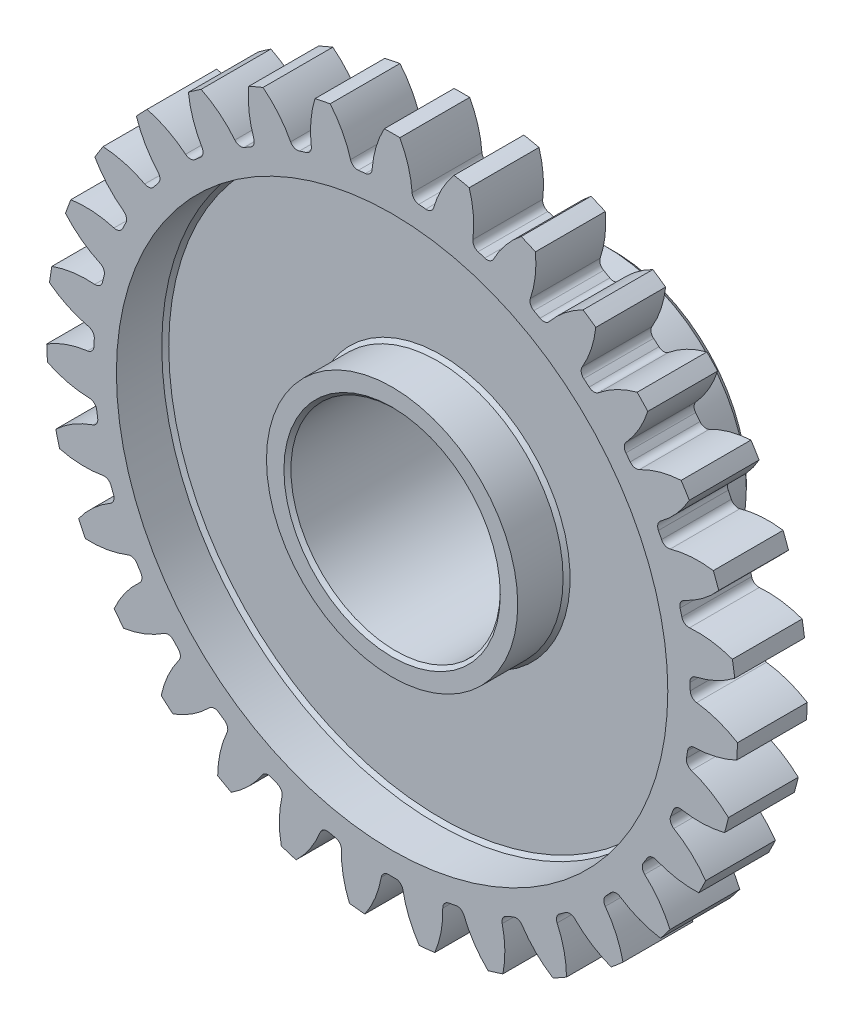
from build123d import *

# Parameters (mm, degrees)
ESQUISSE1_R                        = 20
BASE_EXTRUSION_DEPTH               = 21.75
BOSS_EXTRU_1_DEPTH                 = 10
CONG_1_R                           = 1.05
R_P_TITION_CIRCULAIRE4_COUNT       = 31
CONG_1_OF_R_P_TITION_CIRCULAIRE4_R = 1.05
CONG_2_R                           = 2
ESQUISSE4_R                        = 15
ENL_V_MAT_EXTRU_1_DEPTH            = 77.854468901
CHANFREIN1_SIZE                    = 0.5
CHANFREIN2_SIZE                    = 1
ESQUISSE6_W                        = 8
ESQUISSE6_H                        = 21.5
CHANFREIN3_SIZE                    = 0.5
TROU_TARAUD_M8X1_251_D             = 6.8
TROU_TARAUD_M8X1_251_DEPTH         = 19.75
TROU_TARAUD_M8X1_251_TIP           = 2.042926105


with BuildPart() as part:
    # Esquisse1 → Base-Extrusion (new body)
    with BuildSketch(Plane.XY):
        Circle(ESQUISSE1_R)
    extrude(amount=BASE_EXTRUSION_DEPTH)

    # Esquisse3 → Boss.-Extru.1 (add)
    with BuildSketch(Plane.XY.offset(21.75)):
        with BuildLine():
            Line((-4.324945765, 42.530663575), (0, 0))
            Line((0, 0), (4.324945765, 42.530663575))
            ThreePointArc((4.324945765, 42.530663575), (3.616678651, 42.596738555), (2.907410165, 42.65101952))
            ThreePointArc((2.907410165, 42.65101952), (2.426447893, 46.17903843), (1.110381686, 49.487544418))
            ThreePointArc((1.110381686, 49.487544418), (0, 49.5), (-1.110381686, 49.487544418))
            ThreePointArc((-1.110381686, 49.487544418), (-2.426447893, 46.17903843), (-2.907410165, 42.65101952))
            ThreePointArc((-2.907410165, 42.65101952), (-3.616678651, 42.596738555), (-4.324945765, 42.530663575))
        make_face()
    boss_extru_1 = extrude(amount=BOSS_EXTRU_1_DEPTH)

    # Cong_1
    cong_1_edges = [part.edges().sort_by_distance(p)[0] for p in [
        (2.907410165, 42.65101952, 26.75),
        (-2.907410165, 42.65101952, 26.75),
    ]]
    fillet(cong_1_edges, radius=CONG_1_R)

    # R_p_tition circulaire4: Boss.-Extru.1 ×31 about axis
    r_p_tition_circulaire4_axis = Axis((0, 0, 0), (0, 0, 1))
    for i in range(1, R_P_TITION_CIRCULAIRE4_COUNT):
        add(boss_extru_1.rotate(r_p_tition_circulaire4_axis, i * 360 / R_P_TITION_CIRCULAIRE4_COUNT))

    # Cong_1 of R_p_tition circulaire4
    cong_1_of_r_p_tition_circulaire4_edges = [part.edges().sort_by_distance(p)[0] for p in [
        (-5.737691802, 42.363208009, 26.75),
        (-11.433482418, 41.192693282, 26.75),
        (-14.147891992, 40.341041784, 26.75),
        (-19.491466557, 38.04793334, 26.75),
        (-21.978875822, 36.667308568, 26.75),
        (-26.751467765, 33.345486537, 26.75),
        (-28.910041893, 31.492411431, 26.75),
        (-32.91626074, 27.277871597, 26.75),
        (-34.657627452, 25.028211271, 26.75),
        (-37.733458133, 20.09349739, 26.75),
        (-38.986325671, 17.5393532, 26.75),
        (-41.005843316, 12.086493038, 26.75),
        (-41.718919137, 9.332431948, 26.75),
        (-42.599444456, 3.584666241, 26.75),
        (-42.743535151, 0.743439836, 26.75),
        (-42.449019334, -5.063917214, 26.75),
        (-42.018225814, -7.875988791, 26.75),
        (-40.560726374, -13.505183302, 26.75),
        (-39.572685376, -16.17297351, 26.75),
        (-37.01187251, -21.393545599, 26.75),
        (-35.507034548, -23.807834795, 26.75),
        (-31.947748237, -28.406053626, 26.75),
        (-29.987721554, -30.468000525, 26.75),
        (-25.575679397, -34.25561448, 26.75),
        (-23.240707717, -35.880802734, 26.75),
        (-18.156539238, -38.702746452, 26.75),
        (-15.542216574, -39.824640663, 26.75),
        (-9.994068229, -41.565383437, 26.75),
        (-7.207425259, -42.138053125, 26.75),
        (-1.422438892, -42.72632874, 26.75),
        (1.422438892, -42.72632874, 26.75),
        (7.207425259, -42.138053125, 26.75),
        (9.994068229, -41.565383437, 26.75),
        (15.542216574, -39.824640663, 26.75),
        (18.156539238, -38.702746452, 26.75),
        (23.240707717, -35.880802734, 26.75),
        (25.575679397, -34.25561448, 26.75),
        (29.987721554, -30.468000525, 26.75),
        (31.947748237, -28.406053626, 26.75),
        (35.507034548, -23.807834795, 26.75),
        (37.01187251, -21.393545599, 26.75),
        (39.572685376, -16.17297351, 26.75),
        (40.560726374, -13.505183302, 26.75),
        (42.018225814, -7.875988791, 26.75),
        (42.449019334, -5.063917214, 26.75),
        (42.743535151, 0.743439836, 26.75),
        (42.599444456, 3.584666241, 26.75),
        (41.718919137, 9.332431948, 26.75),
        (41.005843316, 12.086493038, 26.75),
        (38.986325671, 17.5393532, 26.75),
        (37.733458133, 20.09349739, 26.75),
        (34.657627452, 25.028211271, 26.75),
        (32.91626074, 27.277871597, 26.75),
        (28.910041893, 31.492411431, 26.75),
        (26.751467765, 33.345486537, 26.75),
        (21.978875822, 36.667308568, 26.75),
        (19.491466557, 38.04793334, 26.75),
        (14.147891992, 40.341041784, 26.75),
        (11.433482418, 41.192693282, 26.75),
        (5.737691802, 42.363208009, 26.75),
    ]]
    fillet(cong_1_of_r_p_tition_circulaire4_edges, radius=CONG_1_OF_R_P_TITION_CIRCULAIRE4_R)

    # Cong_2
    cong_2_edges = [part.edges().sort_by_distance(p)[0] for p in [
        (-20, 0, 21.75),
    ]]
    fillet(cong_2_edges, radius=CONG_2_R)

    # Esquisse4 → Enl_v. mat.-Extru.1 (cut, through all)
    with BuildSketch(Plane(origin=(0, 0, 0), x_dir=(-1, 0, 0), z_dir=(0, 0, -1))):
        Circle(ESQUISSE4_R)
    extrude(amount=-ENL_V_MAT_EXTRU_1_DEPTH, mode=Mode.SUBTRACT)

    # Chanfrein1
    chanfrein1_edges = [part.edges().sort_by_distance(p)[0] for p in [
        (15, 0, 31.75),
        (15, 0, 0),
    ]]
    chamfer(chanfrein1_edges, length=CHANFREIN1_SIZE)

    # Chanfrein2
    chanfrein2_edges = [part.edges().sort_by_distance(p)[0] for p in [
        (-20, 0, 0),
    ]]
    chamfer(chanfrein2_edges, length=CHANFREIN2_SIZE)

    # Esquisse6 → videment (revolve, cut)
    with BuildSketch(Plane(origin=(0, 0, 0), x_dir=(0, 0, -1), z_dir=(1, 0, 0)), mode=Mode.PRIVATE) as videment_sk:
        with Locations((-28.75, 28.75)):
            Rectangle(ESQUISSE6_W, ESQUISSE6_H)
    revolve(videment_sk.sketch.rotate(Axis((0, 0, -8.59928329), (0, 0, 1)), 270), axis=Axis((0, 0, -8.59928329), (0, 0, 1)), mode=Mode.SUBTRACT)

    # Chanfrein3
    chanfrein3_edges = [part.edges().sort_by_distance(p)[0] for p in [
        (-39.5, 0, 24.75),
        (-18, 0, 24.75),
    ]]
    chamfer(chanfrein3_edges, length=CHANFREIN3_SIZE)

    # Trou taraud_ M8x1.251
    with Locations(Plane(origin=(0, 20, 11), x_dir=(1, 0, 0), z_dir=(0, 1, 0))):
        with Locations((0, 0)):
            Hole(TROU_TARAUD_M8X1_251_D / 2, depth=TROU_TARAUD_M8X1_251_DEPTH)
            with Locations((0, 0, -(TROU_TARAUD_M8X1_251_DEPTH + TROU_TARAUD_M8X1_251_TIP / 2))):  # 118° drill point
                Cone(0, TROU_TARAUD_M8X1_251_D / 2, TROU_TARAUD_M8X1_251_TIP, mode=Mode.SUBTRACT)


solid = part.part
